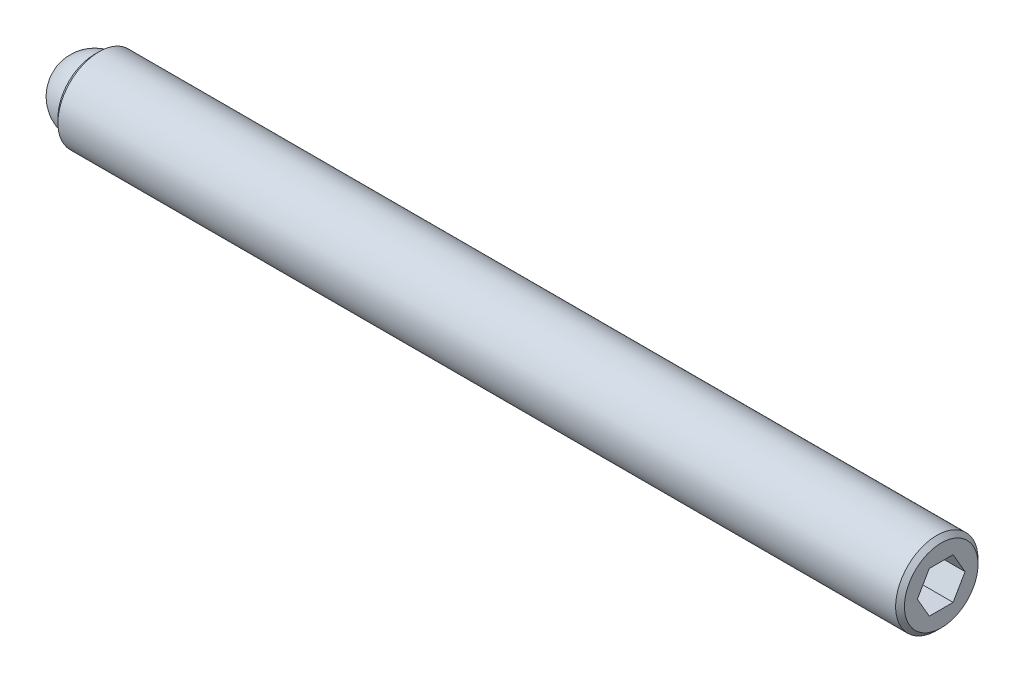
ISO-10303-21;
HEADER;
FILE_DESCRIPTION(('STEP AP214'),'2;1');
FILE_NAME('part.step','',(''),(''),'','','');
FILE_SCHEMA(('AUTOMOTIVE_DESIGN { 1 0 10303 214 1 1 1 1 }'));
ENDSEC;
DATA;
#1=APPLICATION_CONTEXT('core data for automotive mechanical design processes');
#2=APPLICATION_PROTOCOL_DEFINITION('international standard','automotive_design',2000,#1);
#3=PRODUCT_CONTEXT('',#1,'mechanical');
#4=PRODUCT('Part','Part','',(#3));
#5=PRODUCT_RELATED_PRODUCT_CATEGORY('part','',(#4));
#6=PRODUCT_DEFINITION_FORMATION('','',#4);
#7=PRODUCT_DEFINITION_CONTEXT('part definition',#1,'design');
#8=PRODUCT_DEFINITION('design','',#6,#7);
#9=PRODUCT_DEFINITION_SHAPE('','',#8);
#10=(LENGTH_UNIT() NAMED_UNIT(*) SI_UNIT(.MILLI.,.METRE.));
#11=(NAMED_UNIT(*) PLANE_ANGLE_UNIT() SI_UNIT($,.RADIAN.));
#12=(NAMED_UNIT(*) SI_UNIT($,.STERADIAN.) SOLID_ANGLE_UNIT());
#13=UNCERTAINTY_MEASURE_WITH_UNIT(LENGTH_MEASURE(1.E-05),#10,'distance_accuracy_value','');
#14=(GEOMETRIC_REPRESENTATION_CONTEXT(3) GLOBAL_UNCERTAINTY_ASSIGNED_CONTEXT((#13)) GLOBAL_UNIT_ASSIGNED_CONTEXT((#10,
#11,#12)) REPRESENTATION_CONTEXT('',''));
#15=CARTESIAN_POINT('',(0.,0.,0.));
#16=DIRECTION('',(0.,0.,1.));
#17=DIRECTION('',(1.,0.,0.));
#18=AXIS2_PLACEMENT_3D('',#15,#16,#17);
#19=CARTESIAN_POINT('',(0.,0.,0.));
#20=DIRECTION('',(0.,-1.,0.));
#21=DIRECTION('',(0.,0.,1.));
#22=AXIS2_PLACEMENT_3D('',#19,#20,#21);
#23=SPHERICAL_SURFACE('',#22,1.984375);
#24=CARTESIAN_POINT('',(0.,-1.984375,0.));
#25=VERTEX_POINT('',#24);
#26=VERTEX_LOOP('',#25);
#27=FACE_BOUND('',#26,.T.);
#28=ADVANCED_FACE('F41',(#27),#23,.T.);
#29=CLOSED_SHELL('',(#28));
#30=MANIFOLD_SOLID_BREP('B2',#29);
#31=CARTESIAN_POINT('',(48.815625,0.,0.));
#32=DIRECTION('',(-1.,0.,0.));
#33=DIRECTION('',(0.,0.,1.));
#34=AXIS2_PLACEMENT_3D('',#31,#32,#33);
#35=CYLINDRICAL_SURFACE('',#34,2.3749);
#36=CARTESIAN_POINT('',(48.561625,0.,0.));
#37=DIRECTION('',(1.,0.,0.));
#38=DIRECTION('',(0.,0.,-1.));
#39=AXIS2_PLACEMENT_3D('',#36,#37,#38);
#40=CIRCLE('',#39,2.3749);
#41=CARTESIAN_POINT('',(48.561625,0.,-2.3749));
#42=VERTEX_POINT('',#41);
#43=EDGE_CURVE('E39',#42,#42,#40,.F.);
#44=ORIENTED_EDGE('',*,*,#43,.T.);
#45=EDGE_LOOP('',(#44));
#46=FACE_BOUND('',#45,.T.);
#47=CARTESIAN_POINT('',(0.25399999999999,0.,0.));
#48=DIRECTION('',(1.,0.,0.));
#49=DIRECTION('',(0.,0.,-1.));
#50=AXIS2_PLACEMENT_3D('',#47,#48,#49);
#51=CIRCLE('',#50,2.3749);
#52=CARTESIAN_POINT('',(0.25399999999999,0.,-2.3749));
#53=VERTEX_POINT('',#52);
#54=EDGE_CURVE('E157',#53,#53,#51,.T.);
#55=ORIENTED_EDGE('',*,*,#54,.T.);
#56=EDGE_LOOP('',(#55));
#57=FACE_BOUND('',#56,.T.);
#58=ADVANCED_FACE('F54',(#46,#57),#35,.T.);
#59=CARTESIAN_POINT('',(48.815625,0.,0.));
#60=DIRECTION('',(1.,0.,0.));
#61=DIRECTION('',(0.,0.,-1.));
#62=AXIS2_PLACEMENT_3D('',#59,#60,#61);
#63=PLANE('',#62);
#64=DIRECTION('',(0.,0.866025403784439,-0.5));
#65=VECTOR('',#64,1.);
#66=CARTESIAN_POINT('',(48.815625,-1.190625,-0.687407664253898));
#67=LINE('',#66,#65);
#68=CARTESIAN_POINT('',(48.815625,-1.190625,-0.687407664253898));
#69=VERTEX_POINT('',#68);
#70=CARTESIAN_POINT('',(48.815625,0.,-1.3748153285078));
#71=VERTEX_POINT('',#70);
#72=EDGE_CURVE('E69',#69,#71,#67,.T.);
#73=ORIENTED_EDGE('',*,*,#72,.F.);
#74=DIRECTION('',(0.,0.,-1.));
#75=VECTOR('',#74,1.);
#76=CARTESIAN_POINT('',(48.815625,-1.190625,0.687407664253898));
#77=LINE('',#76,#75);
#78=CARTESIAN_POINT('',(48.815625,-1.190625,0.687407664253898));
#79=VERTEX_POINT('',#78);
#80=EDGE_CURVE('E153',#79,#69,#77,.T.);
#81=ORIENTED_EDGE('',*,*,#80,.F.);
#82=DIRECTION('',(0.,-0.866025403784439,-0.5));
#83=VECTOR('',#82,1.);
#84=CARTESIAN_POINT('',(48.815625,0.,1.3748153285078));
#85=LINE('',#84,#83);
#86=CARTESIAN_POINT('',(48.815625,0.,1.3748153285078));
#87=VERTEX_POINT('',#86);
#88=EDGE_CURVE('E151',#87,#79,#85,.T.);
#89=ORIENTED_EDGE('',*,*,#88,.F.);
#90=DIRECTION('',(0.,-0.866025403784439,0.5));
#91=VECTOR('',#90,1.);
#92=CARTESIAN_POINT('',(48.815625,1.190625,0.687407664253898));
#93=LINE('',#92,#91);
#94=CARTESIAN_POINT('',(48.815625,1.190625,0.687407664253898));
#95=VERTEX_POINT('',#94);
#96=EDGE_CURVE('E117',#95,#87,#93,.T.);
#97=ORIENTED_EDGE('',*,*,#96,.F.);
#98=DIRECTION('',(0.,0.,1.));
#99=VECTOR('',#98,1.);
#100=CARTESIAN_POINT('',(48.815625,1.190625,-0.687407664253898));
#101=LINE('',#100,#99);
#102=CARTESIAN_POINT('',(48.815625,1.190625,-0.687407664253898));
#103=VERTEX_POINT('',#102);
#104=EDGE_CURVE('E147',#103,#95,#101,.T.);
#105=ORIENTED_EDGE('',*,*,#104,.F.);
#106=DIRECTION('',(0.,0.866025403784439,0.5));
#107=VECTOR('',#106,1.);
#108=CARTESIAN_POINT('',(48.815625,0.,-1.3748153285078));
#109=LINE('',#108,#107);
#110=EDGE_CURVE('E143',#71,#103,#109,.T.);
#111=ORIENTED_EDGE('',*,*,#110,.F.);
#112=EDGE_LOOP('',(#73,#81,#89,#97,#105,#111));
#113=FACE_BOUND('',#112,.T.);
#114=CARTESIAN_POINT('',(48.815625,0.,0.));
#115=DIRECTION('',(1.,0.,0.));
#116=DIRECTION('',(0.,0.,-1.));
#117=AXIS2_PLACEMENT_3D('',#114,#115,#116);
#118=CIRCLE('',#117,2.1209);
#119=CARTESIAN_POINT('',(48.815625,0.,-2.1209));
#120=VERTEX_POINT('',#119);
#121=EDGE_CURVE('E62',#120,#120,#118,.T.);
#122=ORIENTED_EDGE('',*,*,#121,.T.);
#123=EDGE_LOOP('',(#122));
#124=FACE_BOUND('',#123,.T.);
#125=ADVANCED_FACE('F170',(#113,#124),#63,.T.);
#126=CARTESIAN_POINT('',(0.,0.,0.));
#127=DIRECTION('',(1.,0.,0.));
#128=DIRECTION('',(0.,0.,-1.));
#129=AXIS2_PLACEMENT_3D('',#126,#127,#128);
#130=PLANE('',#129);
#131=CARTESIAN_POINT('',(0.,0.,0.));
#132=DIRECTION('',(-1.,0.,0.));
#133=DIRECTION('',(0.,0.,1.));
#134=AXIS2_PLACEMENT_3D('',#131,#132,#133);
#135=CIRCLE('',#134,1.9812);
#136=CARTESIAN_POINT('',(0.,0.,1.9812));
#137=VERTEX_POINT('',#136);
#138=EDGE_CURVE('E225',#137,#137,#135,.T.);
#139=ORIENTED_EDGE('',*,*,#138,.F.);
#140=EDGE_LOOP('',(#139));
#141=FACE_BOUND('',#140,.T.);
#142=CARTESIAN_POINT('',(0.,0.,0.));
#143=DIRECTION('',(1.,0.,0.));
#144=DIRECTION('',(0.,0.,-1.));
#145=AXIS2_PLACEMENT_3D('',#142,#143,#144);
#146=CIRCLE('',#145,2.12090000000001);
#147=CARTESIAN_POINT('',(0.,0.,-2.12090000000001));
#148=VERTEX_POINT('',#147);
#149=EDGE_CURVE('E165',#148,#148,#146,.F.);
#150=ORIENTED_EDGE('',*,*,#149,.T.);
#151=EDGE_LOOP('',(#150));
#152=FACE_BOUND('',#151,.T.);
#153=ADVANCED_FACE('F182',(#141,#152),#130,.F.);
#154=CARTESIAN_POINT('',(0.25399999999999,0.,0.));
#155=DIRECTION('',(1.,0.,0.));
#156=DIRECTION('',(0.,0.,-1.));
#157=AXIS2_PLACEMENT_3D('',#154,#155,#156);
#158=CONICAL_SURFACE('',#157,2.3749,0.785398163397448);
#159=ORIENTED_EDGE('',*,*,#149,.F.);
#160=EDGE_LOOP('',(#159));
#161=FACE_BOUND('',#160,.T.);
#162=ORIENTED_EDGE('',*,*,#54,.F.);
#163=EDGE_LOOP('',(#162));
#164=FACE_BOUND('',#163,.T.);
#165=ADVANCED_FACE('F174',(#161,#164),#158,.T.);
#166=CARTESIAN_POINT('',(48.815625,0.,0.));
#167=DIRECTION('',(-1.,0.,0.));
#168=DIRECTION('',(0.,0.,1.));
#169=AXIS2_PLACEMENT_3D('',#166,#167,#168);
#170=CONICAL_SURFACE('',#169,2.1209,0.785398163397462);
#171=ORIENTED_EDGE('',*,*,#43,.F.);
#172=EDGE_LOOP('',(#171));
#173=FACE_BOUND('',#172,.T.);
#174=ORIENTED_EDGE('',*,*,#121,.F.);
#175=EDGE_LOOP('',(#174));
#176=FACE_BOUND('',#175,.T.);
#177=ADVANCED_FACE('F56',(#173,#176),#170,.T.);
#178=CARTESIAN_POINT('',(46.529625,-1.190625,-0.687407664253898));
#179=DIRECTION('',(0.,-0.5,-0.866025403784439));
#180=DIRECTION('',(0.,0.866025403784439,-0.5));
#181=AXIS2_PLACEMENT_3D('',#178,#179,#180);
#182=PLANE('',#181);
#183=ORIENTED_EDGE('',*,*,#72,.T.);
#184=DIRECTION('',(1.,0.,0.));
#185=VECTOR('',#184,1.);
#186=CARTESIAN_POINT('',(46.529625,0.,-1.3748153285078));
#187=LINE('',#186,#185);
#188=CARTESIAN_POINT('',(46.529625,0.,-1.3748153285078));
#189=VERTEX_POINT('',#188);
#190=EDGE_CURVE('E99',#189,#71,#187,.T.);
#191=ORIENTED_EDGE('',*,*,#190,.F.);
#192=DIRECTION('',(0.,0.866025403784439,-0.5));
#193=VECTOR('',#192,1.);
#194=CARTESIAN_POINT('',(46.529625,-1.190625,-0.687407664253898));
#195=LINE('',#194,#193);
#196=CARTESIAN_POINT('',(46.529625,-1.190625,-0.687407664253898));
#197=VERTEX_POINT('',#196);
#198=EDGE_CURVE('E155',#197,#189,#195,.T.);
#199=ORIENTED_EDGE('',*,*,#198,.F.);
#200=DIRECTION('',(1.,0.,0.));
#201=VECTOR('',#200,1.);
#202=CARTESIAN_POINT('',(46.529625,-1.190625,-0.687407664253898));
#203=LINE('',#202,#201);
#204=EDGE_CURVE('E77',#197,#69,#203,.T.);
#205=ORIENTED_EDGE('',*,*,#204,.T.);
#206=EDGE_LOOP('',(#183,#191,#199,#205));
#207=FACE_BOUND('',#206,.T.);
#208=ADVANCED_FACE('F173',(#207),#182,.F.);
#209=CARTESIAN_POINT('',(46.529625,-1.190625,0.687407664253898));
#210=DIRECTION('',(0.,-1.,0.));
#211=DIRECTION('',(0.,0.,-1.));
#212=AXIS2_PLACEMENT_3D('',#209,#210,#211);
#213=PLANE('',#212);
#214=ORIENTED_EDGE('',*,*,#80,.T.);
#215=ORIENTED_EDGE('',*,*,#204,.F.);
#216=DIRECTION('',(0.,0.,-1.));
#217=VECTOR('',#216,1.);
#218=CARTESIAN_POINT('',(46.529625,-1.190625,0.687407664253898));
#219=LINE('',#218,#217);
#220=CARTESIAN_POINT('',(46.529625,-1.190625,0.687407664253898));
#221=VERTEX_POINT('',#220);
#222=EDGE_CURVE('E129',#221,#197,#219,.T.);
#223=ORIENTED_EDGE('',*,*,#222,.F.);
#224=DIRECTION('',(1.,0.,0.));
#225=VECTOR('',#224,1.);
#226=CARTESIAN_POINT('',(46.529625,-1.190625,0.687407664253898));
#227=LINE('',#226,#225);
#228=EDGE_CURVE('E121',#221,#79,#227,.T.);
#229=ORIENTED_EDGE('',*,*,#228,.T.);
#230=EDGE_LOOP('',(#214,#215,#223,#229));
#231=FACE_BOUND('',#230,.T.);
#232=ADVANCED_FACE('F180',(#231),#213,.F.);
#233=CARTESIAN_POINT('',(46.529625,0.,1.3748153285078));
#234=DIRECTION('',(0.,-0.5,0.866025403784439));
#235=DIRECTION('',(0.,-0.866025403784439,-0.5));
#236=AXIS2_PLACEMENT_3D('',#233,#234,#235);
#237=PLANE('',#236);
#238=ORIENTED_EDGE('',*,*,#88,.T.);
#239=ORIENTED_EDGE('',*,*,#228,.F.);
#240=DIRECTION('',(0.,-0.866025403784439,-0.5));
#241=VECTOR('',#240,1.);
#242=CARTESIAN_POINT('',(46.529625,0.,1.3748153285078));
#243=LINE('',#242,#241);
#244=CARTESIAN_POINT('',(46.529625,0.,1.3748153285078));
#245=VERTEX_POINT('',#244);
#246=EDGE_CURVE('E125',#245,#221,#243,.T.);
#247=ORIENTED_EDGE('',*,*,#246,.F.);
#248=DIRECTION('',(1.,0.,0.));
#249=VECTOR('',#248,1.);
#250=CARTESIAN_POINT('',(46.529625,0.,1.3748153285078));
#251=LINE('',#250,#249);
#252=EDGE_CURVE('E110',#245,#87,#251,.T.);
#253=ORIENTED_EDGE('',*,*,#252,.T.);
#254=EDGE_LOOP('',(#238,#239,#247,#253));
#255=FACE_BOUND('',#254,.T.);
#256=ADVANCED_FACE('F126',(#255),#237,.F.);
#257=CARTESIAN_POINT('',(46.529625,1.190625,0.687407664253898));
#258=DIRECTION('',(0.,0.5,0.866025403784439));
#259=DIRECTION('',(0.,-0.866025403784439,0.5));
#260=AXIS2_PLACEMENT_3D('',#257,#258,#259);
#261=PLANE('',#260);
#262=ORIENTED_EDGE('',*,*,#96,.T.);
#263=ORIENTED_EDGE('',*,*,#252,.F.);
#264=DIRECTION('',(0.,-0.866025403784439,0.5));
#265=VECTOR('',#264,1.);
#266=CARTESIAN_POINT('',(46.529625,1.190625,0.687407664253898));
#267=LINE('',#266,#265);
#268=CARTESIAN_POINT('',(46.529625,1.190625,0.687407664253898));
#269=VERTEX_POINT('',#268);
#270=EDGE_CURVE('E114',#269,#245,#267,.T.);
#271=ORIENTED_EDGE('',*,*,#270,.F.);
#272=DIRECTION('',(1.,0.,0.));
#273=VECTOR('',#272,1.);
#274=CARTESIAN_POINT('',(46.529625,1.190625,0.687407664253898));
#275=LINE('',#274,#273);
#276=EDGE_CURVE('E122',#269,#95,#275,.T.);
#277=ORIENTED_EDGE('',*,*,#276,.T.);
#278=EDGE_LOOP('',(#262,#263,#271,#277));
#279=FACE_BOUND('',#278,.T.);
#280=ADVANCED_FACE('F112',(#279),#261,.F.);
#281=CARTESIAN_POINT('',(46.529625,1.190625,-0.687407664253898));
#282=DIRECTION('',(0.,1.,0.));
#283=DIRECTION('',(0.,0.,1.));
#284=AXIS2_PLACEMENT_3D('',#281,#282,#283);
#285=PLANE('',#284);
#286=ORIENTED_EDGE('',*,*,#104,.T.);
#287=ORIENTED_EDGE('',*,*,#276,.F.);
#288=DIRECTION('',(0.,0.,1.));
#289=VECTOR('',#288,1.);
#290=CARTESIAN_POINT('',(46.529625,1.190625,-0.687407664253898));
#291=LINE('',#290,#289);
#292=CARTESIAN_POINT('',(46.529625,1.190625,-0.687407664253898));
#293=VERTEX_POINT('',#292);
#294=EDGE_CURVE('E135',#293,#269,#291,.T.);
#295=ORIENTED_EDGE('',*,*,#294,.F.);
#296=DIRECTION('',(1.,0.,0.));
#297=VECTOR('',#296,1.);
#298=CARTESIAN_POINT('',(46.529625,1.190625,-0.687407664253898));
#299=LINE('',#298,#297);
#300=EDGE_CURVE('E160',#293,#103,#299,.T.);
#301=ORIENTED_EDGE('',*,*,#300,.T.);
#302=EDGE_LOOP('',(#286,#287,#295,#301));
#303=FACE_BOUND('',#302,.T.);
#304=ADVANCED_FACE('F201',(#303),#285,.F.);
#305=CARTESIAN_POINT('',(46.529625,0.,-1.3748153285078));
#306=DIRECTION('',(0.,0.5,-0.866025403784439));
#307=DIRECTION('',(0.,0.866025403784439,0.5));
#308=AXIS2_PLACEMENT_3D('',#305,#306,#307);
#309=PLANE('',#308);
#310=ORIENTED_EDGE('',*,*,#110,.T.);
#311=ORIENTED_EDGE('',*,*,#300,.F.);
#312=DIRECTION('',(0.,0.866025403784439,0.5));
#313=VECTOR('',#312,1.);
#314=CARTESIAN_POINT('',(46.529625,0.,-1.3748153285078));
#315=LINE('',#314,#313);
#316=EDGE_CURVE('E137',#189,#293,#315,.T.);
#317=ORIENTED_EDGE('',*,*,#316,.F.);
#318=ORIENTED_EDGE('',*,*,#190,.T.);
#319=EDGE_LOOP('',(#310,#311,#317,#318));
#320=FACE_BOUND('',#319,.T.);
#321=ADVANCED_FACE('F198',(#320),#309,.F.);
#322=CARTESIAN_POINT('',(46.529625,0.,0.));
#323=DIRECTION('',(1.,0.,0.));
#324=DIRECTION('',(0.,0.,-1.));
#325=AXIS2_PLACEMENT_3D('',#322,#323,#324);
#326=PLANE('',#325);
#327=ORIENTED_EDGE('',*,*,#198,.T.);
#328=ORIENTED_EDGE('',*,*,#316,.T.);
#329=ORIENTED_EDGE('',*,*,#294,.T.);
#330=ORIENTED_EDGE('',*,*,#270,.T.);
#331=ORIENTED_EDGE('',*,*,#246,.T.);
#332=ORIENTED_EDGE('',*,*,#222,.T.);
#333=EDGE_LOOP('',(#327,#328,#329,#330,#331,#332));
#334=FACE_BOUND('',#333,.T.);
#335=ADVANCED_FACE('F132',(#334),#326,.T.);
#336=CARTESIAN_POINT('',(1.984375,0.,0.));
#337=DIRECTION('',(-1.,0.,0.));
#338=DIRECTION('',(0.,0.,1.));
#339=AXIS2_PLACEMENT_3D('',#336,#337,#338);
#340=CYLINDRICAL_SURFACE('',#339,1.9812);
#341=CARTESIAN_POINT('',(1.984375,0.,0.));
#342=DIRECTION('',(-1.,0.,0.));
#343=DIRECTION('',(0.,0.,1.));
#344=AXIS2_PLACEMENT_3D('',#341,#342,#343);
#345=CIRCLE('',#344,1.9812);
#346=CARTESIAN_POINT('',(1.984375,0.,1.9812));
#347=VERTEX_POINT('',#346);
#348=EDGE_CURVE('E144',#347,#347,#345,.T.);
#349=ORIENTED_EDGE('',*,*,#348,.F.);
#350=EDGE_LOOP('',(#349));
#351=FACE_BOUND('',#350,.T.);
#352=ORIENTED_EDGE('',*,*,#138,.T.);
#353=EDGE_LOOP('',(#352));
#354=FACE_BOUND('',#353,.T.);
#355=ADVANCED_FACE('F214',(#351,#354),#340,.F.);
#356=CARTESIAN_POINT('',(1.984375,0.,0.));
#357=DIRECTION('',(-1.,0.,0.));
#358=DIRECTION('',(0.,0.,1.));
#359=AXIS2_PLACEMENT_3D('',#356,#357,#358);
#360=PLANE('',#359);
#361=ORIENTED_EDGE('',*,*,#348,.T.);
#362=EDGE_LOOP('',(#361));
#363=FACE_BOUND('',#362,.T.);
#364=ADVANCED_FACE('F217',(#363),#360,.T.);
#365=CLOSED_SHELL('',(#58,#125,#153,#165,#177,#208,#232,#256,#280,#304,#321,#335,#355,#364));
#366=MANIFOLD_SOLID_BREP('B6',#365);
#367=ADVANCED_BREP_SHAPE_REPRESENTATION('',(#18,#30,#366),#14);
#368=SHAPE_DEFINITION_REPRESENTATION(#9,#367);
ENDSEC;
END-ISO-10303-21;
